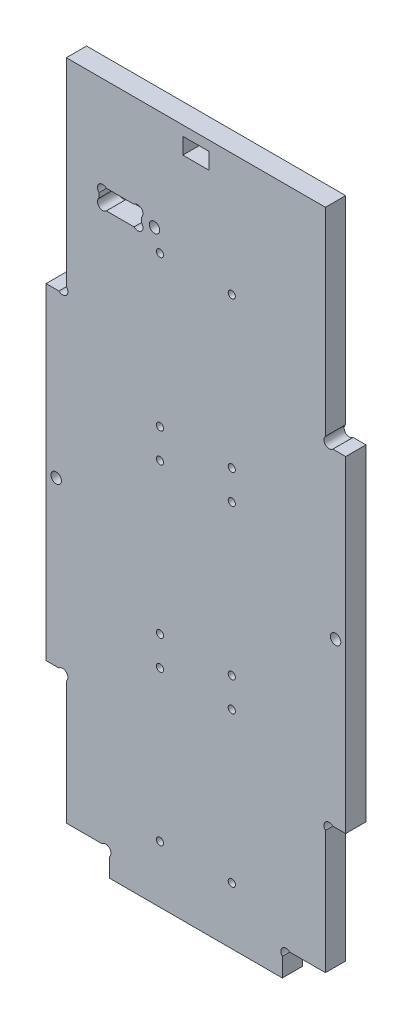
from build123d import *

# Parameters (mm, degrees)
ESQUISSE1_R      = 1.6
ESQUISSE1_R_2    = 1.1
ESQUISSE1_W      = 8
ESQUISSE1_H      = 5
EXTRUSION1_DEPTH = 6.2


with BuildPart() as part:
    # Esquisse1 → Extrusion1 (new body)
    with BuildSketch(Plane.XY):
        with BuildLine():
            Line((6.2, 47.7372583), (6.2, 10))
            Line((6.2, 10), (17.1372583, 10))
            ThreePointArc((17.1372583, 10), (19.4, 10), (19.4, 7.7372583))
            Line((19.4, 7.7372583), (19.4, 2))
            Line((19.4, 2), (72.35, 2))
            Line((72.35, 2), (72.35, 7.7372583))
            ThreePointArc((72.35, 7.7372583), (72.35, 10), (74.6127417, 10))
            Line((74.6127417, 10), (85.55, 10))
            Line((85.55, 10), (85.55, 47.7372583))
            ThreePointArc((85.55, 47.7372583), (85.55, 50), (87.8127417, 50))
            Line((87.8127417, 50), (91.75, 50))
            Line((91.75, 50), (91.75, 150))
            Line((91.75, 150), (87.8127417, 150))
            ThreePointArc((87.8127417, 150), (85.55, 150), (85.55, 152.2627417))
            Line((85.55, 152.2627417), (85.55, 213))
            Line((85.55, 213), (6.2, 213))
            Line((6.2, 213), (6.2, 152.2627417))
            ThreePointArc((6.2, 152.2627417), (6.2, 150), (3.9372583, 150))
            Line((3.9372583, 150), (0, 150))
            Line((0, 150), (0, 50))
            Line((0, 50), (3.9372583, 50))
            ThreePointArc((3.9372583, 50), (6.2, 50), (6.2, 47.7372583))
        make_face()
        with Locations(Location((3.1, 100, 0), (0, 0, 180))):
            Circle(ESQUISSE1_R, mode=Mode.SUBTRACT)
        with Locations(Location((88.65, 100, 0), (0, 0, 180))):
            Circle(ESQUISSE1_R, mode=Mode.SUBTRACT)
        with Locations(Location((56.875, 120.5, 0), (0, 0, 180))):
            Circle(ESQUISSE1_R_2, mode=Mode.SUBTRACT)
        with Locations(Location((34.875, 120.5, 0), (0, 0, 180))):
            Circle(ESQUISSE1_R_2, mode=Mode.SUBTRACT)
        with Locations(Location((34.875, 175.5, 0), (0, 0, 180))):
            Circle(ESQUISSE1_R_2, mode=Mode.SUBTRACT)
        with Locations(Location((56.875, 175.5, 0), (0, 0, 180))):
            Circle(ESQUISSE1_R_2, mode=Mode.SUBTRACT)
        with Locations(Location((34.875, 19.5, 0), (0, 0, 180))):
            Circle(ESQUISSE1_R_2, mode=Mode.SUBTRACT)
        with Locations(Location((34.875, 65.5, 0), (0, 0, 180))):
            Circle(ESQUISSE1_R_2, mode=Mode.SUBTRACT)
        with Locations(Location((56.875, 19.5, 0), (0, 0, 180))):
            Circle(ESQUISSE1_R_2, mode=Mode.SUBTRACT)
        with Locations(Location((56.875, 65.5, 0), (0, 0, 180))):
            Circle(ESQUISSE1_R_2, mode=Mode.SUBTRACT)
        with Locations(Location((56.875, 74.5, 0), (0, 0, 180))):
            Circle(ESQUISSE1_R_2, mode=Mode.SUBTRACT)
        with Locations(Location((34.875, 74.5, 0), (0, 0, 180))):
            Circle(ESQUISSE1_R_2, mode=Mode.SUBTRACT)
        with Locations(Location((34.875, 129.5, 0), (0, 0, 180))):
            Circle(ESQUISSE1_R_2, mode=Mode.SUBTRACT)
        with Locations(Location((56.875, 129.5, 0), (0, 0, 180))):
            Circle(ESQUISSE1_R_2, mode=Mode.SUBTRACT)
        with Locations(Location((33.2, 181.5, 0), (0, 0, 180))):
            Circle(ESQUISSE1_R, mode=Mode.SUBTRACT)
        with Locations((45.875, 207.5)):
            Rectangle(ESQUISSE1_W, ESQUISSE1_H, mode=Mode.SUBTRACT)
        with BuildLine():
            Line((16.2, 182.2372583), (16.2, 180.7627417))
            ThreePointArc((16.2, 180.7627417), (16.2, 178.5), (18.4627417, 178.5))
            Line((18.4627417, 178.5), (26.9372583, 178.5))
            ThreePointArc((26.9372583, 178.5), (29.2, 178.5), (29.2, 180.7627417))
            Line((29.2, 180.7627417), (29.2, 182.2372583))
            ThreePointArc((29.2, 182.2372583), (29.2, 184.5), (26.9372583, 184.5))
            Line((26.9372583, 184.5), (18.4627417, 184.5))
            ThreePointArc((18.4627417, 184.5), (16.2, 184.5), (16.2, 182.2372583))
        make_face(mode=Mode.SUBTRACT)
    extrude(amount=EXTRUSION1_DEPTH)


solid = part.part
